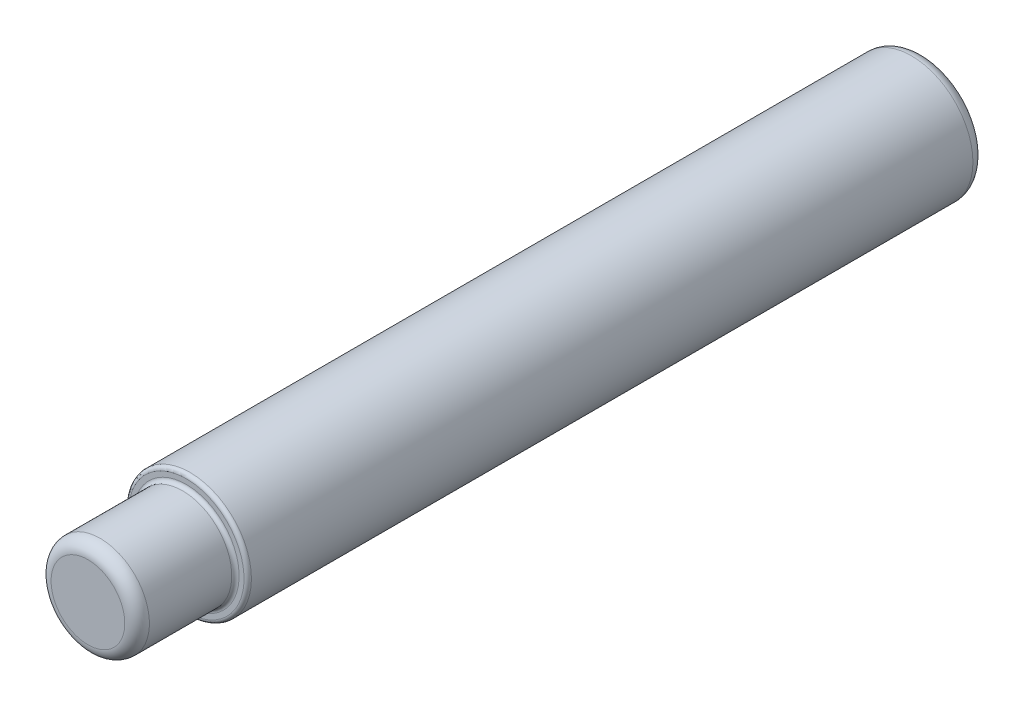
ISO-10303-21;
HEADER;
FILE_DESCRIPTION(('STEP AP214'),'2;1');
FILE_NAME('part.step','',(''),(''),'','','');
FILE_SCHEMA(('AUTOMOTIVE_DESIGN { 1 0 10303 214 1 1 1 1 }'));
ENDSEC;
DATA;
#1=APPLICATION_CONTEXT('core data for automotive mechanical design processes');
#2=APPLICATION_PROTOCOL_DEFINITION('international standard','automotive_design',2000,#1);
#3=PRODUCT_CONTEXT('',#1,'mechanical');
#4=PRODUCT('Part','Part','',(#3));
#5=PRODUCT_RELATED_PRODUCT_CATEGORY('part','',(#4));
#6=PRODUCT_DEFINITION_FORMATION('','',#4);
#7=PRODUCT_DEFINITION_CONTEXT('part definition',#1,'design');
#8=PRODUCT_DEFINITION('design','',#6,#7);
#9=PRODUCT_DEFINITION_SHAPE('','',#8);
#10=(LENGTH_UNIT() NAMED_UNIT(*) SI_UNIT(.MILLI.,.METRE.));
#11=(NAMED_UNIT(*) PLANE_ANGLE_UNIT() SI_UNIT($,.RADIAN.));
#12=(NAMED_UNIT(*) SI_UNIT($,.STERADIAN.) SOLID_ANGLE_UNIT());
#13=UNCERTAINTY_MEASURE_WITH_UNIT(LENGTH_MEASURE(1.E-05),#10,'distance_accuracy_value','');
#14=(GEOMETRIC_REPRESENTATION_CONTEXT(3) GLOBAL_UNCERTAINTY_ASSIGNED_CONTEXT((#13)) GLOBAL_UNIT_ASSIGNED_CONTEXT((#10,
#11,#12)) REPRESENTATION_CONTEXT('',''));
#15=CARTESIAN_POINT('',(0.,0.,0.));
#16=DIRECTION('',(0.,0.,1.));
#17=DIRECTION('',(1.,0.,0.));
#18=AXIS2_PLACEMENT_3D('',#15,#16,#17);
#19=CARTESIAN_POINT('',(0.,2.,17.));
#20=DIRECTION('',(0.,0.,-1.));
#21=DIRECTION('',(-1.,0.,0.));
#22=AXIS2_PLACEMENT_3D('',#19,#20,#21);
#23=PLANE('',#22);
#24=CARTESIAN_POINT('',(0.,0.,17.));
#25=DIRECTION('',(0.,0.,-1.));
#26=DIRECTION('',(-1.,0.,0.));
#27=AXIS2_PLACEMENT_3D('',#24,#25,#26);
#28=CIRCLE('',#27,1.5);
#29=CARTESIAN_POINT('',(-1.5,0.,17.));
#30=VERTEX_POINT('',#29);
#31=EDGE_CURVE('E58',#30,#30,#28,.F.);
#32=ORIENTED_EDGE('',*,*,#31,.T.);
#33=EDGE_LOOP('',(#32));
#34=FACE_BOUND('',#33,.T.);
#35=ADVANCED_FACE('F29',(#34),#23,.F.);
#36=CARTESIAN_POINT('',(0.,0.,-17.));
#37=DIRECTION('',(0.,0.,1.));
#38=DIRECTION('',(1.,0.,0.));
#39=AXIS2_PLACEMENT_3D('',#36,#37,#38);
#40=PLANE('',#39);
#41=CARTESIAN_POINT('',(0.,0.,-17.));
#42=DIRECTION('',(0.,0.,1.));
#43=DIRECTION('',(1.,0.,0.));
#44=AXIS2_PLACEMENT_3D('',#41,#42,#43);
#45=CIRCLE('',#44,2.);
#46=CARTESIAN_POINT('',(2.,0.,-17.));
#47=VERTEX_POINT('',#46);
#48=EDGE_CURVE('E49',#47,#47,#45,.F.);
#49=ORIENTED_EDGE('',*,*,#48,.T.);
#50=EDGE_LOOP('',(#49));
#51=FACE_BOUND('',#50,.T.);
#52=ADVANCED_FACE('F81',(#51),#40,.F.);
#53=CARTESIAN_POINT('',(0.,0.,17.));
#54=DIRECTION('',(0.,0.,1.));
#55=DIRECTION('',(1.,0.,0.));
#56=AXIS2_PLACEMENT_3D('',#53,#54,#55);
#57=CYLINDRICAL_SURFACE('',#56,2.5);
#58=CARTESIAN_POINT('',(0.,0.,12.85));
#59=DIRECTION('',(0.,0.,-1.));
#60=DIRECTION('',(-1.,0.,0.));
#61=AXIS2_PLACEMENT_3D('',#58,#59,#60);
#62=CIRCLE('',#61,2.5);
#63=CARTESIAN_POINT('',(-2.5,0.,12.85));
#64=VERTEX_POINT('',#63);
#65=EDGE_CURVE('E36',#64,#64,#62,.T.);
#66=ORIENTED_EDGE('',*,*,#65,.T.);
#67=EDGE_LOOP('',(#66));
#68=FACE_BOUND('',#67,.T.);
#69=CARTESIAN_POINT('',(0.,0.,-16.5));
#70=DIRECTION('',(0.,0.,1.));
#71=DIRECTION('',(1.,0.,0.));
#72=AXIS2_PLACEMENT_3D('',#69,#70,#71);
#73=CIRCLE('',#72,2.5);
#74=CARTESIAN_POINT('',(2.5,0.,-16.5));
#75=VERTEX_POINT('',#74);
#76=EDGE_CURVE('E52',#75,#75,#73,.T.);
#77=ORIENTED_EDGE('',*,*,#76,.T.);
#78=EDGE_LOOP('',(#77));
#79=FACE_BOUND('',#78,.T.);
#80=ADVANCED_FACE('F85',(#68,#79),#57,.T.);
#81=CARTESIAN_POINT('',(0.,2.5,13.));
#82=DIRECTION('',(0.,0.,-1.));
#83=DIRECTION('',(-1.,0.,0.));
#84=AXIS2_PLACEMENT_3D('',#81,#82,#83);
#85=PLANE('',#84);
#86=CARTESIAN_POINT('',(0.,0.,13.));
#87=DIRECTION('',(0.,0.,-1.));
#88=DIRECTION('',(-1.,0.,0.));
#89=AXIS2_PLACEMENT_3D('',#86,#87,#88);
#90=CIRCLE('',#89,2.35);
#91=CARTESIAN_POINT('',(-2.35,0.,13.));
#92=VERTEX_POINT('',#91);
#93=EDGE_CURVE('E40',#92,#92,#90,.F.);
#94=ORIENTED_EDGE('',*,*,#93,.T.);
#95=EDGE_LOOP('',(#94));
#96=FACE_BOUND('',#95,.T.);
#97=CARTESIAN_POINT('',(0.,0.,13.));
#98=DIRECTION('',(0.,0.,-1.));
#99=DIRECTION('',(-1.,0.,0.));
#100=AXIS2_PLACEMENT_3D('',#97,#98,#99);
#101=CIRCLE('',#100,2.15);
#102=CARTESIAN_POINT('',(-2.15,0.,13.));
#103=VERTEX_POINT('',#102);
#104=EDGE_CURVE('E44',#103,#103,#101,.T.);
#105=ORIENTED_EDGE('',*,*,#104,.T.);
#106=EDGE_LOOP('',(#105));
#107=FACE_BOUND('',#106,.T.);
#108=ADVANCED_FACE('F76',(#96,#107),#85,.F.);
#109=CARTESIAN_POINT('',(0.,0.,17.));
#110=DIRECTION('',(0.,0.,1.));
#111=DIRECTION('',(1.,0.,0.));
#112=AXIS2_PLACEMENT_3D('',#109,#110,#111);
#113=CYLINDRICAL_SURFACE('',#112,2.);
#114=CARTESIAN_POINT('',(0.,0.,13.15));
#115=DIRECTION('',(0.,0.,-1.));
#116=DIRECTION('',(-1.,0.,0.));
#117=AXIS2_PLACEMENT_3D('',#114,#115,#116);
#118=CIRCLE('',#117,2.);
#119=CARTESIAN_POINT('',(-2.,0.,13.15));
#120=VERTEX_POINT('',#119);
#121=EDGE_CURVE('E10',#120,#120,#118,.F.);
#122=ORIENTED_EDGE('',*,*,#121,.T.);
#123=EDGE_LOOP('',(#122));
#124=FACE_BOUND('',#123,.T.);
#125=CARTESIAN_POINT('',(0.,0.,16.5));
#126=DIRECTION('',(0.,0.,-1.));
#127=DIRECTION('',(-1.,0.,0.));
#128=AXIS2_PLACEMENT_3D('',#125,#126,#127);
#129=CIRCLE('',#128,2.);
#130=CARTESIAN_POINT('',(-2.,0.,16.5));
#131=VERTEX_POINT('',#130);
#132=EDGE_CURVE('E55',#131,#131,#129,.T.);
#133=ORIENTED_EDGE('',*,*,#132,.T.);
#134=EDGE_LOOP('',(#133));
#135=FACE_BOUND('',#134,.T.);
#136=ADVANCED_FACE('F66',(#124,#135),#113,.T.);
#137=CARTESIAN_POINT('',(0.,0.,16.5));
#138=DIRECTION('',(0.,0.,-1.));
#139=DIRECTION('',(-1.,0.,0.));
#140=AXIS2_PLACEMENT_3D('',#137,#138,#139);
#141=TOROIDAL_SURFACE('',#140,1.5,0.5);
#142=ORIENTED_EDGE('',*,*,#132,.F.);
#143=EDGE_LOOP('',(#142));
#144=FACE_BOUND('',#143,.T.);
#145=ORIENTED_EDGE('',*,*,#31,.F.);
#146=EDGE_LOOP('',(#145));
#147=FACE_BOUND('',#146,.T.);
#148=ADVANCED_FACE('F63',(#144,#147),#141,.T.);
#149=CARTESIAN_POINT('',(0.,0.,-16.5));
#150=DIRECTION('',(0.,0.,1.));
#151=DIRECTION('',(1.,0.,0.));
#152=AXIS2_PLACEMENT_3D('',#149,#150,#151);
#153=TOROIDAL_SURFACE('',#152,2.,0.5);
#154=ORIENTED_EDGE('',*,*,#48,.F.);
#155=EDGE_LOOP('',(#154));
#156=FACE_BOUND('',#155,.T.);
#157=ORIENTED_EDGE('',*,*,#76,.F.);
#158=EDGE_LOOP('',(#157));
#159=FACE_BOUND('',#158,.T.);
#160=ADVANCED_FACE('F65',(#156,#159),#153,.T.);
#161=CARTESIAN_POINT('',(0.,0.,12.85));
#162=DIRECTION('',(0.,0.,-1.));
#163=DIRECTION('',(-1.,0.,0.));
#164=AXIS2_PLACEMENT_3D('',#161,#162,#163);
#165=TOROIDAL_SURFACE('',#164,2.35,0.15);
#166=ORIENTED_EDGE('',*,*,#65,.F.);
#167=EDGE_LOOP('',(#166));
#168=FACE_BOUND('',#167,.T.);
#169=ORIENTED_EDGE('',*,*,#93,.F.);
#170=EDGE_LOOP('',(#169));
#171=FACE_BOUND('',#170,.T.);
#172=ADVANCED_FACE('F73',(#168,#171),#165,.T.);
#173=CARTESIAN_POINT('',(0.,0.,13.15));
#174=DIRECTION('',(0.,0.,-1.));
#175=DIRECTION('',(-1.,0.,0.));
#176=AXIS2_PLACEMENT_3D('',#173,#174,#175);
#177=TOROIDAL_SURFACE('',#176,2.15,0.15);
#178=ORIENTED_EDGE('',*,*,#104,.F.);
#179=EDGE_LOOP('',(#178));
#180=FACE_BOUND('',#179,.T.);
#181=ORIENTED_EDGE('',*,*,#121,.F.);
#182=EDGE_LOOP('',(#181));
#183=FACE_BOUND('',#182,.T.);
#184=ADVANCED_FACE('F31',(#180,#183),#177,.F.);
#185=CLOSED_SHELL('',(#35,#52,#80,#108,#136,#148,#160,#172,#184));
#186=MANIFOLD_SOLID_BREP('B2',#185);
#187=ADVANCED_BREP_SHAPE_REPRESENTATION('',(#18,#186),#14);
#188=SHAPE_DEFINITION_REPRESENTATION(#9,#187);
ENDSEC;
END-ISO-10303-21;
